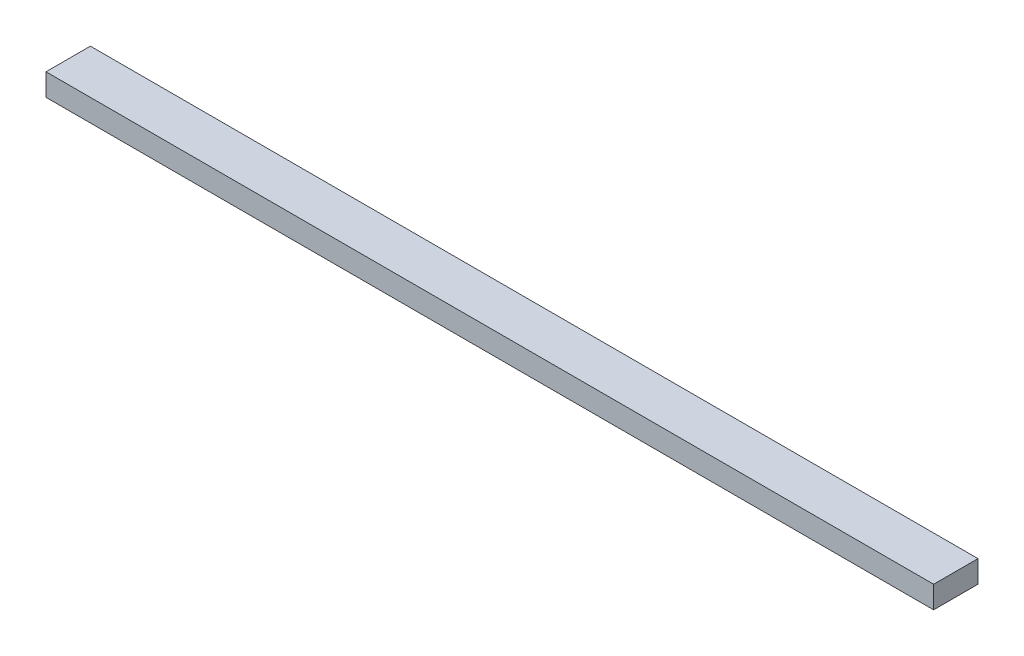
ISO-10303-21;
HEADER;
FILE_DESCRIPTION(('STEP AP214'),'2;1');
FILE_NAME('part.step','',(''),(''),'','','');
FILE_SCHEMA(('AUTOMOTIVE_DESIGN { 1 0 10303 214 1 1 1 1 }'));
ENDSEC;
DATA;
#1=APPLICATION_CONTEXT('core data for automotive mechanical design processes');
#2=APPLICATION_PROTOCOL_DEFINITION('international standard','automotive_design',2000,#1);
#3=PRODUCT_CONTEXT('',#1,'mechanical');
#4=PRODUCT('Part','Part','',(#3));
#5=PRODUCT_RELATED_PRODUCT_CATEGORY('part','',(#4));
#6=PRODUCT_DEFINITION_FORMATION('','',#4);
#7=PRODUCT_DEFINITION_CONTEXT('part definition',#1,'design');
#8=PRODUCT_DEFINITION('design','',#6,#7);
#9=PRODUCT_DEFINITION_SHAPE('','',#8);
#10=(LENGTH_UNIT() NAMED_UNIT(*) SI_UNIT(.MILLI.,.METRE.));
#11=(NAMED_UNIT(*) PLANE_ANGLE_UNIT() SI_UNIT($,.RADIAN.));
#12=(NAMED_UNIT(*) SI_UNIT($,.STERADIAN.) SOLID_ANGLE_UNIT());
#13=UNCERTAINTY_MEASURE_WITH_UNIT(LENGTH_MEASURE(1.E-05),#10,'distance_accuracy_value','');
#14=(GEOMETRIC_REPRESENTATION_CONTEXT(3) GLOBAL_UNCERTAINTY_ASSIGNED_CONTEXT((#13)) GLOBAL_UNIT_ASSIGNED_CONTEXT((#10,
#11,#12)) REPRESENTATION_CONTEXT('',''));
#15=CARTESIAN_POINT('',(0.,0.,0.));
#16=DIRECTION('',(0.,0.,1.));
#17=DIRECTION('',(1.,0.,0.));
#18=AXIS2_PLACEMENT_3D('',#15,#16,#17);
#19=CARTESIAN_POINT('',(-10000.,500.,500.000000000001));
#20=DIRECTION('',(1.,0.,0.));
#21=DIRECTION('',(0.,0.,-1.));
#22=AXIS2_PLACEMENT_3D('',#19,#20,#21);
#23=PLANE('',#22);
#24=DIRECTION('',(0.,0.,1.));
#25=VECTOR('',#24,1.);
#26=CARTESIAN_POINT('',(-10000.,0.,500.000000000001));
#27=LINE('',#26,#25);
#28=CARTESIAN_POINT('',(-10000.,0.,-499.999999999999));
#29=VERTEX_POINT('',#28);
#30=CARTESIAN_POINT('',(-10000.,0.,500.000000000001));
#31=VERTEX_POINT('',#30);
#32=EDGE_CURVE('E102',#29,#31,#27,.T.);
#33=ORIENTED_EDGE('',*,*,#32,.T.);
#34=DIRECTION('',(0.,-1.,0.));
#35=VECTOR('',#34,1.);
#36=CARTESIAN_POINT('',(-10000.,500.,500.000000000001));
#37=LINE('',#36,#35);
#38=CARTESIAN_POINT('',(-10000.,500.,500.000000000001));
#39=VERTEX_POINT('',#38);
#40=EDGE_CURVE('E11',#39,#31,#37,.T.);
#41=ORIENTED_EDGE('',*,*,#40,.F.);
#42=DIRECTION('',(0.,0.,1.));
#43=VECTOR('',#42,1.);
#44=CARTESIAN_POINT('',(-10000.,500.,500.000000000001));
#45=LINE('',#44,#43);
#46=CARTESIAN_POINT('',(-10000.,500.,-499.999999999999));
#47=VERTEX_POINT('',#46);
#48=EDGE_CURVE('E90',#47,#39,#45,.T.);
#49=ORIENTED_EDGE('',*,*,#48,.F.);
#50=DIRECTION('',(0.,-1.,0.));
#51=VECTOR('',#50,1.);
#52=CARTESIAN_POINT('',(-10000.,500.,-499.999999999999));
#53=LINE('',#52,#51);
#54=EDGE_CURVE('E98',#47,#29,#53,.T.);
#55=ORIENTED_EDGE('',*,*,#54,.T.);
#56=EDGE_LOOP('',(#33,#41,#49,#55));
#57=FACE_BOUND('',#56,.T.);
#58=ADVANCED_FACE('F39',(#57),#23,.F.);
#59=CARTESIAN_POINT('',(10000.,500.,499.999999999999));
#60=DIRECTION('',(0.,0.,-1.));
#61=DIRECTION('',(-1.,0.,0.));
#62=AXIS2_PLACEMENT_3D('',#59,#60,#61);
#63=PLANE('',#62);
#64=DIRECTION('',(1.,0.,0.));
#65=VECTOR('',#64,1.);
#66=CARTESIAN_POINT('',(10000.,0.,499.999999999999));
#67=LINE('',#66,#65);
#68=CARTESIAN_POINT('',(10000.,0.,499.999999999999));
#69=VERTEX_POINT('',#68);
#70=EDGE_CURVE('E94',#31,#69,#67,.T.);
#71=ORIENTED_EDGE('',*,*,#70,.T.);
#72=DIRECTION('',(0.,-1.,0.));
#73=VECTOR('',#72,1.);
#74=CARTESIAN_POINT('',(10000.,500.,499.999999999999));
#75=LINE('',#74,#73);
#76=CARTESIAN_POINT('',(10000.,500.,499.999999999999));
#77=VERTEX_POINT('',#76);
#78=EDGE_CURVE('E47',#77,#69,#75,.T.);
#79=ORIENTED_EDGE('',*,*,#78,.F.);
#80=DIRECTION('',(1.,0.,0.));
#81=VECTOR('',#80,1.);
#82=CARTESIAN_POINT('',(10000.,500.,499.999999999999));
#83=LINE('',#82,#81);
#84=EDGE_CURVE('E85',#39,#77,#83,.T.);
#85=ORIENTED_EDGE('',*,*,#84,.F.);
#86=ORIENTED_EDGE('',*,*,#40,.T.);
#87=EDGE_LOOP('',(#71,#79,#85,#86));
#88=FACE_BOUND('',#87,.T.);
#89=ADVANCED_FACE('F93',(#88),#63,.F.);
#90=CARTESIAN_POINT('',(10000.,500.,499.999999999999));
#91=DIRECTION('',(-1.,0.,0.));
#92=DIRECTION('',(0.,0.,1.));
#93=AXIS2_PLACEMENT_3D('',#90,#91,#92);
#94=PLANE('',#93);
#95=DIRECTION('',(0.,0.,-1.));
#96=VECTOR('',#95,1.);
#97=CARTESIAN_POINT('',(10000.,0.,499.999999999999));
#98=LINE('',#97,#96);
#99=CARTESIAN_POINT('',(10000.,0.,-500.000000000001));
#100=VERTEX_POINT('',#99);
#101=EDGE_CURVE('E72',#69,#100,#98,.T.);
#102=ORIENTED_EDGE('',*,*,#101,.T.);
#103=DIRECTION('',(0.,-1.,0.));
#104=VECTOR('',#103,1.);
#105=CARTESIAN_POINT('',(10000.,500.,-500.000000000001));
#106=LINE('',#105,#104);
#107=CARTESIAN_POINT('',(10000.,500.,-500.000000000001));
#108=VERTEX_POINT('',#107);
#109=EDGE_CURVE('E95',#108,#100,#106,.T.);
#110=ORIENTED_EDGE('',*,*,#109,.F.);
#111=DIRECTION('',(0.,0.,-1.));
#112=VECTOR('',#111,1.);
#113=CARTESIAN_POINT('',(10000.,500.,499.999999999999));
#114=LINE('',#113,#112);
#115=EDGE_CURVE('E88',#77,#108,#114,.T.);
#116=ORIENTED_EDGE('',*,*,#115,.F.);
#117=ORIENTED_EDGE('',*,*,#78,.T.);
#118=EDGE_LOOP('',(#102,#110,#116,#117));
#119=FACE_BOUND('',#118,.T.);
#120=ADVANCED_FACE('F96',(#119),#94,.F.);
#121=CARTESIAN_POINT('',(10000.,500.,-500.000000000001));
#122=DIRECTION('',(0.,0.,1.));
#123=DIRECTION('',(1.,0.,0.));
#124=AXIS2_PLACEMENT_3D('',#121,#122,#123);
#125=PLANE('',#124);
#126=DIRECTION('',(-1.,0.,0.));
#127=VECTOR('',#126,1.);
#128=CARTESIAN_POINT('',(10000.,0.,-500.000000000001));
#129=LINE('',#128,#127);
#130=EDGE_CURVE('E78',#100,#29,#129,.T.);
#131=ORIENTED_EDGE('',*,*,#130,.T.);
#132=ORIENTED_EDGE('',*,*,#54,.F.);
#133=DIRECTION('',(-1.,0.,0.));
#134=VECTOR('',#133,1.);
#135=CARTESIAN_POINT('',(10000.,500.,-500.000000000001));
#136=LINE('',#135,#134);
#137=EDGE_CURVE('E55',#108,#47,#136,.T.);
#138=ORIENTED_EDGE('',*,*,#137,.F.);
#139=ORIENTED_EDGE('',*,*,#109,.T.);
#140=EDGE_LOOP('',(#131,#132,#138,#139));
#141=FACE_BOUND('',#140,.T.);
#142=ADVANCED_FACE('F109',(#141),#125,.F.);
#143=CARTESIAN_POINT('',(0.,500.,0.));
#144=DIRECTION('',(0.,1.,0.));
#145=DIRECTION('',(0.,0.,1.));
#146=AXIS2_PLACEMENT_3D('',#143,#144,#145);
#147=PLANE('',#146);
#148=ORIENTED_EDGE('',*,*,#48,.T.);
#149=ORIENTED_EDGE('',*,*,#84,.T.);
#150=ORIENTED_EDGE('',*,*,#115,.T.);
#151=ORIENTED_EDGE('',*,*,#137,.T.);
#152=EDGE_LOOP('',(#148,#149,#150,#151));
#153=FACE_BOUND('',#152,.T.);
#154=ADVANCED_FACE('F86',(#153),#147,.T.);
#155=CARTESIAN_POINT('',(0.,0.,0.));
#156=DIRECTION('',(0.,1.,0.));
#157=DIRECTION('',(0.,0.,1.));
#158=AXIS2_PLACEMENT_3D('',#155,#156,#157);
#159=PLANE('',#158);
#160=ORIENTED_EDGE('',*,*,#32,.F.);
#161=ORIENTED_EDGE('',*,*,#130,.F.);
#162=ORIENTED_EDGE('',*,*,#101,.F.);
#163=ORIENTED_EDGE('',*,*,#70,.F.);
#164=EDGE_LOOP('',(#160,#161,#162,#163));
#165=FACE_BOUND('',#164,.T.);
#166=ADVANCED_FACE('F112',(#165),#159,.F.);
#167=CLOSED_SHELL('',(#58,#89,#120,#142,#154,#166));
#168=MANIFOLD_SOLID_BREP('B2',#167);
#169=ADVANCED_BREP_SHAPE_REPRESENTATION('',(#18,#168),#14);
#170=SHAPE_DEFINITION_REPRESENTATION(#9,#169);
ENDSEC;
END-ISO-10303-21;
